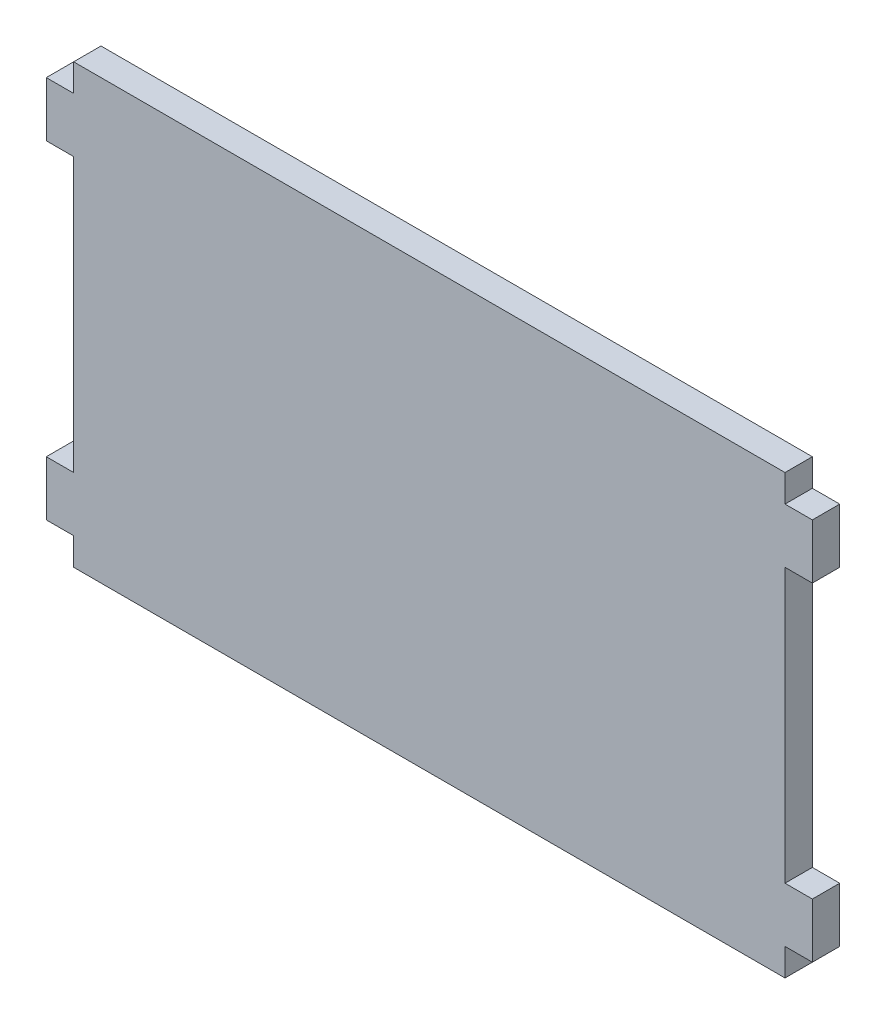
ISO-10303-21;
HEADER;
FILE_DESCRIPTION(('STEP AP214'),'2;1');
FILE_NAME('part.step','',(''),(''),'','','');
FILE_SCHEMA(('AUTOMOTIVE_DESIGN { 1 0 10303 214 1 1 1 1 }'));
ENDSEC;
DATA;
#1=APPLICATION_CONTEXT('core data for automotive mechanical design processes');
#2=APPLICATION_PROTOCOL_DEFINITION('international standard','automotive_design',2000,#1);
#3=PRODUCT_CONTEXT('',#1,'mechanical');
#4=PRODUCT('Part','Part','',(#3));
#5=PRODUCT_RELATED_PRODUCT_CATEGORY('part','',(#4));
#6=PRODUCT_DEFINITION_FORMATION('','',#4);
#7=PRODUCT_DEFINITION_CONTEXT('part definition',#1,'design');
#8=PRODUCT_DEFINITION('design','',#6,#7);
#9=PRODUCT_DEFINITION_SHAPE('','',#8);
#10=(LENGTH_UNIT() NAMED_UNIT(*) SI_UNIT(.MILLI.,.METRE.));
#11=(NAMED_UNIT(*) PLANE_ANGLE_UNIT() SI_UNIT($,.RADIAN.));
#12=(NAMED_UNIT(*) SI_UNIT($,.STERADIAN.) SOLID_ANGLE_UNIT());
#13=UNCERTAINTY_MEASURE_WITH_UNIT(LENGTH_MEASURE(1.E-05),#10,'distance_accuracy_value','');
#14=(GEOMETRIC_REPRESENTATION_CONTEXT(3) GLOBAL_UNCERTAINTY_ASSIGNED_CONTEXT((#13)) GLOBAL_UNIT_ASSIGNED_CONTEXT((#10,
#11,#12)) REPRESENTATION_CONTEXT('',''));
#15=CARTESIAN_POINT('',(0.,0.,0.));
#16=DIRECTION('',(0.,0.,1.));
#17=DIRECTION('',(1.,0.,0.));
#18=AXIS2_PLACEMENT_3D('',#15,#16,#17);
#19=CARTESIAN_POINT('',(0.,0.,3.175));
#20=DIRECTION('',(1.,0.,0.));
#21=DIRECTION('',(0.,1.,0.));
#22=AXIS2_PLACEMENT_3D('',#19,#20,#21);
#23=PLANE('',#22);
#24=DIRECTION('',(0.,-1.,0.));
#25=VECTOR('',#24,1.);
#26=CARTESIAN_POINT('',(0.,0.,0.));
#27=LINE('',#26,#25);
#28=CARTESIAN_POINT('',(0.,3.175,0.));
#29=VERTEX_POINT('',#28);
#30=CARTESIAN_POINT('',(0.,0.,0.));
#31=VERTEX_POINT('',#30);
#32=EDGE_CURVE('E202',#29,#31,#27,.T.);
#33=ORIENTED_EDGE('',*,*,#32,.T.);
#34=DIRECTION('',(0.,0.,-1.));
#35=VECTOR('',#34,1.);
#36=CARTESIAN_POINT('',(0.,0.,3.175));
#37=LINE('',#36,#35);
#38=CARTESIAN_POINT('',(0.,0.,3.175));
#39=VERTEX_POINT('',#38);
#40=EDGE_CURVE('E11',#39,#31,#37,.T.);
#41=ORIENTED_EDGE('',*,*,#40,.F.);
#42=DIRECTION('',(0.,-1.,0.));
#43=VECTOR('',#42,1.);
#44=CARTESIAN_POINT('',(0.,0.,3.175));
#45=LINE('',#44,#43);
#46=CARTESIAN_POINT('',(0.,3.175,3.175));
#47=VERTEX_POINT('',#46);
#48=EDGE_CURVE('E240',#47,#39,#45,.T.);
#49=ORIENTED_EDGE('',*,*,#48,.F.);
#50=DIRECTION('',(0.,0.,-1.));
#51=VECTOR('',#50,1.);
#52=CARTESIAN_POINT('',(0.,3.175,3.175));
#53=LINE('',#52,#51);
#54=EDGE_CURVE('E198',#47,#29,#53,.T.);
#55=ORIENTED_EDGE('',*,*,#54,.T.);
#56=EDGE_LOOP('',(#33,#41,#49,#55));
#57=FACE_BOUND('',#56,.T.);
#58=ADVANCED_FACE('F34',(#57),#23,.F.);
#59=CARTESIAN_POINT('',(0.,0.,3.175));
#60=DIRECTION('',(0.,1.,0.));
#61=DIRECTION('',(-1.,0.,0.));
#62=AXIS2_PLACEMENT_3D('',#59,#60,#61);
#63=PLANE('',#62);
#64=DIRECTION('',(1.,0.,0.));
#65=VECTOR('',#64,1.);
#66=CARTESIAN_POINT('',(0.,0.,0.));
#67=LINE('',#66,#65);
#68=CARTESIAN_POINT('',(82.55,0.,0.));
#69=VERTEX_POINT('',#68);
#70=EDGE_CURVE('E205',#31,#69,#67,.T.);
#71=ORIENTED_EDGE('',*,*,#70,.T.);
#72=DIRECTION('',(0.,0.,-1.));
#73=VECTOR('',#72,1.);
#74=CARTESIAN_POINT('',(82.55,0.,3.175));
#75=LINE('',#74,#73);
#76=CARTESIAN_POINT('',(82.55,0.,3.175));
#77=VERTEX_POINT('',#76);
#78=EDGE_CURVE('E42',#77,#69,#75,.T.);
#79=ORIENTED_EDGE('',*,*,#78,.F.);
#80=DIRECTION('',(1.,0.,0.));
#81=VECTOR('',#80,1.);
#82=CARTESIAN_POINT('',(0.,0.,3.175));
#83=LINE('',#82,#81);
#84=EDGE_CURVE('E129',#39,#77,#83,.T.);
#85=ORIENTED_EDGE('',*,*,#84,.F.);
#86=ORIENTED_EDGE('',*,*,#40,.T.);
#87=EDGE_LOOP('',(#71,#79,#85,#86));
#88=FACE_BOUND('',#87,.T.);
#89=ADVANCED_FACE('F359',(#88),#63,.F.);
#90=CARTESIAN_POINT('',(82.55,0.,3.175));
#91=DIRECTION('',(-1.,0.,0.));
#92=DIRECTION('',(0.,-1.,0.));
#93=AXIS2_PLACEMENT_3D('',#90,#91,#92);
#94=PLANE('',#93);
#95=DIRECTION('',(0.,1.,0.));
#96=VECTOR('',#95,1.);
#97=CARTESIAN_POINT('',(82.55,0.,0.));
#98=LINE('',#97,#96);
#99=CARTESIAN_POINT('',(82.55,3.17500000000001,0.));
#100=VERTEX_POINT('',#99);
#101=EDGE_CURVE('E207',#69,#100,#98,.T.);
#102=ORIENTED_EDGE('',*,*,#101,.T.);
#103=DIRECTION('',(0.,0.,-1.));
#104=VECTOR('',#103,1.);
#105=CARTESIAN_POINT('',(82.55,3.17500000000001,3.175));
#106=LINE('',#105,#104);
#107=CARTESIAN_POINT('',(82.55,3.17500000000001,3.175));
#108=VERTEX_POINT('',#107);
#109=EDGE_CURVE('E283',#108,#100,#106,.T.);
#110=ORIENTED_EDGE('',*,*,#109,.F.);
#111=DIRECTION('',(0.,1.,0.));
#112=VECTOR('',#111,1.);
#113=CARTESIAN_POINT('',(82.55,0.,3.175));
#114=LINE('',#113,#112);
#115=EDGE_CURVE('E291',#77,#108,#114,.T.);
#116=ORIENTED_EDGE('',*,*,#115,.F.);
#117=ORIENTED_EDGE('',*,*,#78,.T.);
#118=EDGE_LOOP('',(#102,#110,#116,#117));
#119=FACE_BOUND('',#118,.T.);
#120=ADVANCED_FACE('F289',(#119),#94,.F.);
#121=CARTESIAN_POINT('',(82.55,3.17500000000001,3.175));
#122=DIRECTION('',(0.,1.,0.));
#123=DIRECTION('',(-1.,0.,0.));
#124=AXIS2_PLACEMENT_3D('',#121,#122,#123);
#125=PLANE('',#124);
#126=DIRECTION('',(1.,0.,0.));
#127=VECTOR('',#126,1.);
#128=CARTESIAN_POINT('',(82.55,3.17500000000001,0.));
#129=LINE('',#128,#127);
#130=CARTESIAN_POINT('',(85.725,3.17500000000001,0.));
#131=VERTEX_POINT('',#130);
#132=EDGE_CURVE('E209',#100,#131,#129,.T.);
#133=ORIENTED_EDGE('',*,*,#132,.T.);
#134=DIRECTION('',(0.,0.,-1.));
#135=VECTOR('',#134,1.);
#136=CARTESIAN_POINT('',(85.725,3.17500000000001,3.175));
#137=LINE('',#136,#135);
#138=CARTESIAN_POINT('',(85.725,3.17500000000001,3.175));
#139=VERTEX_POINT('',#138);
#140=EDGE_CURVE('E280',#139,#131,#137,.T.);
#141=ORIENTED_EDGE('',*,*,#140,.F.);
#142=DIRECTION('',(1.,0.,0.));
#143=VECTOR('',#142,1.);
#144=CARTESIAN_POINT('',(82.55,3.17500000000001,3.175));
#145=LINE('',#144,#143);
#146=EDGE_CURVE('E309',#108,#139,#145,.T.);
#147=ORIENTED_EDGE('',*,*,#146,.F.);
#148=ORIENTED_EDGE('',*,*,#109,.T.);
#149=EDGE_LOOP('',(#133,#141,#147,#148));
#150=FACE_BOUND('',#149,.T.);
#151=ADVANCED_FACE('F300',(#150),#125,.F.);
#152=CARTESIAN_POINT('',(85.725,3.17500000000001,3.175));
#153=DIRECTION('',(-1.,0.,0.));
#154=DIRECTION('',(0.,0.,1.));
#155=AXIS2_PLACEMENT_3D('',#152,#153,#154);
#156=PLANE('',#155);
#157=DIRECTION('',(0.,1.,0.));
#158=VECTOR('',#157,1.);
#159=CARTESIAN_POINT('',(85.725,3.17500000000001,0.));
#160=LINE('',#159,#158);
#161=CARTESIAN_POINT('',(85.725,9.52500000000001,0.));
#162=VERTEX_POINT('',#161);
#163=EDGE_CURVE('E211',#131,#162,#160,.T.);
#164=ORIENTED_EDGE('',*,*,#163,.T.);
#165=DIRECTION('',(0.,0.,-1.));
#166=VECTOR('',#165,1.);
#167=CARTESIAN_POINT('',(85.725,9.52500000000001,3.175));
#168=LINE('',#167,#166);
#169=CARTESIAN_POINT('',(85.725,9.52500000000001,3.175));
#170=VERTEX_POINT('',#169);
#171=EDGE_CURVE('E277',#170,#162,#168,.T.);
#172=ORIENTED_EDGE('',*,*,#171,.F.);
#173=DIRECTION('',(0.,1.,0.));
#174=VECTOR('',#173,1.);
#175=CARTESIAN_POINT('',(85.725,3.17500000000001,3.175));
#176=LINE('',#175,#174);
#177=EDGE_CURVE('E306',#139,#170,#176,.T.);
#178=ORIENTED_EDGE('',*,*,#177,.F.);
#179=ORIENTED_EDGE('',*,*,#140,.T.);
#180=EDGE_LOOP('',(#164,#172,#178,#179));
#181=FACE_BOUND('',#180,.T.);
#182=ADVANCED_FACE('F304',(#181),#156,.F.);
#183=CARTESIAN_POINT('',(82.55,9.52500000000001,3.175));
#184=DIRECTION('',(0.,-1.,0.));
#185=DIRECTION('',(0.,0.,-1.));
#186=AXIS2_PLACEMENT_3D('',#183,#184,#185);
#187=PLANE('',#186);
#188=DIRECTION('',(-1.,0.,0.));
#189=VECTOR('',#188,1.);
#190=CARTESIAN_POINT('',(82.55,9.52500000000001,0.));
#191=LINE('',#190,#189);
#192=CARTESIAN_POINT('',(82.55,9.52500000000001,0.));
#193=VERTEX_POINT('',#192);
#194=EDGE_CURVE('E213',#162,#193,#191,.T.);
#195=ORIENTED_EDGE('',*,*,#194,.T.);
#196=DIRECTION('',(0.,0.,-1.));
#197=VECTOR('',#196,1.);
#198=CARTESIAN_POINT('',(82.55,9.52500000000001,3.175));
#199=LINE('',#198,#197);
#200=CARTESIAN_POINT('',(82.55,9.52500000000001,3.175));
#201=VERTEX_POINT('',#200);
#202=EDGE_CURVE('E274',#201,#193,#199,.T.);
#203=ORIENTED_EDGE('',*,*,#202,.F.);
#204=DIRECTION('',(-1.,0.,0.));
#205=VECTOR('',#204,1.);
#206=CARTESIAN_POINT('',(82.55,9.52500000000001,3.175));
#207=LINE('',#206,#205);
#208=EDGE_CURVE('E308',#170,#201,#207,.T.);
#209=ORIENTED_EDGE('',*,*,#208,.F.);
#210=ORIENTED_EDGE('',*,*,#171,.T.);
#211=EDGE_LOOP('',(#195,#203,#209,#210));
#212=FACE_BOUND('',#211,.T.);
#213=ADVANCED_FACE('F372',(#212),#187,.F.);
#214=CARTESIAN_POINT('',(82.55,9.52500000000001,3.175));
#215=DIRECTION('',(-1.,0.,0.));
#216=DIRECTION('',(0.,0.,1.));
#217=AXIS2_PLACEMENT_3D('',#214,#215,#216);
#218=PLANE('',#217);
#219=DIRECTION('',(0.,1.,0.));
#220=VECTOR('',#219,1.);
#221=CARTESIAN_POINT('',(82.55,9.52500000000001,0.));
#222=LINE('',#221,#220);
#223=CARTESIAN_POINT('',(82.55,41.275,0.));
#224=VERTEX_POINT('',#223);
#225=EDGE_CURVE('E215',#193,#224,#222,.T.);
#226=ORIENTED_EDGE('',*,*,#225,.T.);
#227=DIRECTION('',(0.,0.,-1.));
#228=VECTOR('',#227,1.);
#229=CARTESIAN_POINT('',(82.55,41.275,3.175));
#230=LINE('',#229,#228);
#231=CARTESIAN_POINT('',(82.55,41.275,3.175));
#232=VERTEX_POINT('',#231);
#233=EDGE_CURVE('E271',#232,#224,#230,.T.);
#234=ORIENTED_EDGE('',*,*,#233,.F.);
#235=DIRECTION('',(0.,1.,0.));
#236=VECTOR('',#235,1.);
#237=CARTESIAN_POINT('',(82.55,9.52500000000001,3.175));
#238=LINE('',#237,#236);
#239=EDGE_CURVE('E311',#201,#232,#238,.T.);
#240=ORIENTED_EDGE('',*,*,#239,.F.);
#241=ORIENTED_EDGE('',*,*,#202,.T.);
#242=EDGE_LOOP('',(#226,#234,#240,#241));
#243=FACE_BOUND('',#242,.T.);
#244=ADVANCED_FACE('F375',(#243),#218,.F.);
#245=CARTESIAN_POINT('',(82.55,41.275,3.175));
#246=DIRECTION('',(0.,1.,0.));
#247=DIRECTION('',(0.,0.,1.));
#248=AXIS2_PLACEMENT_3D('',#245,#246,#247);
#249=PLANE('',#248);
#250=DIRECTION('',(1.,0.,0.));
#251=VECTOR('',#250,1.);
#252=CARTESIAN_POINT('',(82.55,41.275,0.));
#253=LINE('',#252,#251);
#254=CARTESIAN_POINT('',(85.725,41.275,0.));
#255=VERTEX_POINT('',#254);
#256=EDGE_CURVE('E217',#224,#255,#253,.T.);
#257=ORIENTED_EDGE('',*,*,#256,.T.);
#258=DIRECTION('',(0.,0.,-1.));
#259=VECTOR('',#258,1.);
#260=CARTESIAN_POINT('',(85.725,41.275,3.175));
#261=LINE('',#260,#259);
#262=CARTESIAN_POINT('',(85.725,41.275,3.175));
#263=VERTEX_POINT('',#262);
#264=EDGE_CURVE('E268',#263,#255,#261,.T.);
#265=ORIENTED_EDGE('',*,*,#264,.F.);
#266=DIRECTION('',(1.,0.,0.));
#267=VECTOR('',#266,1.);
#268=CARTESIAN_POINT('',(82.55,41.275,3.175));
#269=LINE('',#268,#267);
#270=EDGE_CURVE('E317',#232,#263,#269,.T.);
#271=ORIENTED_EDGE('',*,*,#270,.F.);
#272=ORIENTED_EDGE('',*,*,#233,.T.);
#273=EDGE_LOOP('',(#257,#265,#271,#272));
#274=FACE_BOUND('',#273,.T.);
#275=ADVANCED_FACE('F379',(#274),#249,.F.);
#276=CARTESIAN_POINT('',(85.725,47.625,3.175));
#277=DIRECTION('',(-1.,0.,0.));
#278=DIRECTION('',(0.,0.,1.));
#279=AXIS2_PLACEMENT_3D('',#276,#277,#278);
#280=PLANE('',#279);
#281=DIRECTION('',(0.,1.,0.));
#282=VECTOR('',#281,1.);
#283=CARTESIAN_POINT('',(85.725,47.625,0.));
#284=LINE('',#283,#282);
#285=CARTESIAN_POINT('',(85.725,47.625,0.));
#286=VERTEX_POINT('',#285);
#287=EDGE_CURVE('E219',#255,#286,#284,.T.);
#288=ORIENTED_EDGE('',*,*,#287,.T.);
#289=DIRECTION('',(0.,0.,-1.));
#290=VECTOR('',#289,1.);
#291=CARTESIAN_POINT('',(85.725,47.625,3.175));
#292=LINE('',#291,#290);
#293=CARTESIAN_POINT('',(85.725,47.625,3.175));
#294=VERTEX_POINT('',#293);
#295=EDGE_CURVE('E265',#294,#286,#292,.T.);
#296=ORIENTED_EDGE('',*,*,#295,.F.);
#297=DIRECTION('',(0.,1.,0.));
#298=VECTOR('',#297,1.);
#299=CARTESIAN_POINT('',(85.725,47.625,3.175));
#300=LINE('',#299,#298);
#301=EDGE_CURVE('E319',#263,#294,#300,.T.);
#302=ORIENTED_EDGE('',*,*,#301,.F.);
#303=ORIENTED_EDGE('',*,*,#264,.T.);
#304=EDGE_LOOP('',(#288,#296,#302,#303));
#305=FACE_BOUND('',#304,.T.);
#306=ADVANCED_FACE('F383',(#305),#280,.F.);
#307=CARTESIAN_POINT('',(82.55,47.625,3.175));
#308=DIRECTION('',(0.,-1.,0.));
#309=DIRECTION('',(0.,0.,-1.));
#310=AXIS2_PLACEMENT_3D('',#307,#308,#309);
#311=PLANE('',#310);
#312=DIRECTION('',(-1.,0.,0.));
#313=VECTOR('',#312,1.);
#314=CARTESIAN_POINT('',(82.55,47.625,0.));
#315=LINE('',#314,#313);
#316=CARTESIAN_POINT('',(82.55,47.625,0.));
#317=VERTEX_POINT('',#316);
#318=EDGE_CURVE('E221',#286,#317,#315,.T.);
#319=ORIENTED_EDGE('',*,*,#318,.T.);
#320=DIRECTION('',(0.,0.,-1.));
#321=VECTOR('',#320,1.);
#322=CARTESIAN_POINT('',(82.55,47.625,3.175));
#323=LINE('',#322,#321);
#324=CARTESIAN_POINT('',(82.55,47.625,3.175));
#325=VERTEX_POINT('',#324);
#326=EDGE_CURVE('E262',#325,#317,#323,.T.);
#327=ORIENTED_EDGE('',*,*,#326,.F.);
#328=DIRECTION('',(-1.,0.,0.));
#329=VECTOR('',#328,1.);
#330=CARTESIAN_POINT('',(82.55,47.625,3.175));
#331=LINE('',#330,#329);
#332=EDGE_CURVE('E321',#294,#325,#331,.T.);
#333=ORIENTED_EDGE('',*,*,#332,.F.);
#334=ORIENTED_EDGE('',*,*,#295,.T.);
#335=EDGE_LOOP('',(#319,#327,#333,#334));
#336=FACE_BOUND('',#335,.T.);
#337=ADVANCED_FACE('F387',(#336),#311,.F.);
#338=CARTESIAN_POINT('',(82.55,47.625,3.175));
#339=DIRECTION('',(-1.,0.,0.));
#340=DIRECTION('',(0.,0.,1.));
#341=AXIS2_PLACEMENT_3D('',#338,#339,#340);
#342=PLANE('',#341);
#343=DIRECTION('',(0.,1.,0.));
#344=VECTOR('',#343,1.);
#345=CARTESIAN_POINT('',(82.55,47.625,0.));
#346=LINE('',#345,#344);
#347=CARTESIAN_POINT('',(82.55,50.8,0.));
#348=VERTEX_POINT('',#347);
#349=EDGE_CURVE('E223',#317,#348,#346,.T.);
#350=ORIENTED_EDGE('',*,*,#349,.T.);
#351=DIRECTION('',(0.,0.,-1.));
#352=VECTOR('',#351,1.);
#353=CARTESIAN_POINT('',(82.55,50.8,3.175));
#354=LINE('',#353,#352);
#355=CARTESIAN_POINT('',(82.55,50.8,3.175));
#356=VERTEX_POINT('',#355);
#357=EDGE_CURVE('E259',#356,#348,#354,.T.);
#358=ORIENTED_EDGE('',*,*,#357,.F.);
#359=DIRECTION('',(0.,1.,0.));
#360=VECTOR('',#359,1.);
#361=CARTESIAN_POINT('',(82.55,47.625,3.175));
#362=LINE('',#361,#360);
#363=EDGE_CURVE('E323',#325,#356,#362,.T.);
#364=ORIENTED_EDGE('',*,*,#363,.F.);
#365=ORIENTED_EDGE('',*,*,#326,.T.);
#366=EDGE_LOOP('',(#350,#358,#364,#365));
#367=FACE_BOUND('',#366,.T.);
#368=ADVANCED_FACE('F391',(#367),#342,.F.);
#369=CARTESIAN_POINT('',(0.,50.8,3.175));
#370=DIRECTION('',(0.,-1.,0.));
#371=DIRECTION('',(1.,0.,0.));
#372=AXIS2_PLACEMENT_3D('',#369,#370,#371);
#373=PLANE('',#372);
#374=DIRECTION('',(-1.,0.,0.));
#375=VECTOR('',#374,1.);
#376=CARTESIAN_POINT('',(0.,50.8,0.));
#377=LINE('',#376,#375);
#378=CARTESIAN_POINT('',(0.,50.8,0.));
#379=VERTEX_POINT('',#378);
#380=EDGE_CURVE('E225',#348,#379,#377,.T.);
#381=ORIENTED_EDGE('',*,*,#380,.T.);
#382=DIRECTION('',(0.,0.,-1.));
#383=VECTOR('',#382,1.);
#384=CARTESIAN_POINT('',(0.,50.8,3.175));
#385=LINE('',#384,#383);
#386=CARTESIAN_POINT('',(0.,50.8,3.175));
#387=VERTEX_POINT('',#386);
#388=EDGE_CURVE('E256',#387,#379,#385,.T.);
#389=ORIENTED_EDGE('',*,*,#388,.F.);
#390=DIRECTION('',(-1.,0.,0.));
#391=VECTOR('',#390,1.);
#392=CARTESIAN_POINT('',(0.,50.8,3.175));
#393=LINE('',#392,#391);
#394=EDGE_CURVE('E325',#356,#387,#393,.T.);
#395=ORIENTED_EDGE('',*,*,#394,.F.);
#396=ORIENTED_EDGE('',*,*,#357,.T.);
#397=EDGE_LOOP('',(#381,#389,#395,#396));
#398=FACE_BOUND('',#397,.T.);
#399=ADVANCED_FACE('F395',(#398),#373,.F.);
#400=CARTESIAN_POINT('',(0.,47.625,3.175));
#401=DIRECTION('',(1.,0.,0.));
#402=DIRECTION('',(0.,0.,-1.));
#403=AXIS2_PLACEMENT_3D('',#400,#401,#402);
#404=PLANE('',#403);
#405=DIRECTION('',(0.,-1.,0.));
#406=VECTOR('',#405,1.);
#407=CARTESIAN_POINT('',(0.,47.625,0.));
#408=LINE('',#407,#406);
#409=CARTESIAN_POINT('',(0.,47.625,0.));
#410=VERTEX_POINT('',#409);
#411=EDGE_CURVE('E227',#379,#410,#408,.T.);
#412=ORIENTED_EDGE('',*,*,#411,.T.);
#413=DIRECTION('',(0.,0.,-1.));
#414=VECTOR('',#413,1.);
#415=CARTESIAN_POINT('',(0.,47.625,3.175));
#416=LINE('',#415,#414);
#417=CARTESIAN_POINT('',(0.,47.625,3.175));
#418=VERTEX_POINT('',#417);
#419=EDGE_CURVE('E253',#418,#410,#416,.T.);
#420=ORIENTED_EDGE('',*,*,#419,.F.);
#421=DIRECTION('',(0.,-1.,0.));
#422=VECTOR('',#421,1.);
#423=CARTESIAN_POINT('',(0.,47.625,3.175));
#424=LINE('',#423,#422);
#425=EDGE_CURVE('E327',#387,#418,#424,.T.);
#426=ORIENTED_EDGE('',*,*,#425,.F.);
#427=ORIENTED_EDGE('',*,*,#388,.T.);
#428=EDGE_LOOP('',(#412,#420,#426,#427));
#429=FACE_BOUND('',#428,.T.);
#430=ADVANCED_FACE('F399',(#429),#404,.F.);
#431=CARTESIAN_POINT('',(0.,47.625,3.175));
#432=DIRECTION('',(0.,-1.,0.));
#433=DIRECTION('',(0.,0.,-1.));
#434=AXIS2_PLACEMENT_3D('',#431,#432,#433);
#435=PLANE('',#434);
#436=DIRECTION('',(-1.,0.,0.));
#437=VECTOR('',#436,1.);
#438=CARTESIAN_POINT('',(0.,47.625,0.));
#439=LINE('',#438,#437);
#440=CARTESIAN_POINT('',(-3.175,47.625,0.));
#441=VERTEX_POINT('',#440);
#442=EDGE_CURVE('E229',#410,#441,#439,.T.);
#443=ORIENTED_EDGE('',*,*,#442,.T.);
#444=DIRECTION('',(0.,0.,-1.));
#445=VECTOR('',#444,1.);
#446=CARTESIAN_POINT('',(-3.175,47.625,3.175));
#447=LINE('',#446,#445);
#448=CARTESIAN_POINT('',(-3.175,47.625,3.175));
#449=VERTEX_POINT('',#448);
#450=EDGE_CURVE('E250',#449,#441,#447,.T.);
#451=ORIENTED_EDGE('',*,*,#450,.F.);
#452=DIRECTION('',(-1.,0.,0.));
#453=VECTOR('',#452,1.);
#454=CARTESIAN_POINT('',(0.,47.625,3.175));
#455=LINE('',#454,#453);
#456=EDGE_CURVE('E329',#418,#449,#455,.T.);
#457=ORIENTED_EDGE('',*,*,#456,.F.);
#458=ORIENTED_EDGE('',*,*,#419,.T.);
#459=EDGE_LOOP('',(#443,#451,#457,#458));
#460=FACE_BOUND('',#459,.T.);
#461=ADVANCED_FACE('F403',(#460),#435,.F.);
#462=CARTESIAN_POINT('',(-3.175,47.625,3.175));
#463=DIRECTION('',(1.,0.,0.));
#464=DIRECTION('',(0.,0.,-1.));
#465=AXIS2_PLACEMENT_3D('',#462,#463,#464);
#466=PLANE('',#465);
#467=DIRECTION('',(0.,-1.,0.));
#468=VECTOR('',#467,1.);
#469=CARTESIAN_POINT('',(-3.175,47.625,0.));
#470=LINE('',#469,#468);
#471=CARTESIAN_POINT('',(-3.175,41.275,0.));
#472=VERTEX_POINT('',#471);
#473=EDGE_CURVE('E231',#441,#472,#470,.T.);
#474=ORIENTED_EDGE('',*,*,#473,.T.);
#475=DIRECTION('',(0.,0.,-1.));
#476=VECTOR('',#475,1.);
#477=CARTESIAN_POINT('',(-3.175,41.275,3.175));
#478=LINE('',#477,#476);
#479=CARTESIAN_POINT('',(-3.175,41.275,3.175));
#480=VERTEX_POINT('',#479);
#481=EDGE_CURVE('E247',#480,#472,#478,.T.);
#482=ORIENTED_EDGE('',*,*,#481,.F.);
#483=DIRECTION('',(0.,-1.,0.));
#484=VECTOR('',#483,1.);
#485=CARTESIAN_POINT('',(-3.175,47.625,3.175));
#486=LINE('',#485,#484);
#487=EDGE_CURVE('E331',#449,#480,#486,.T.);
#488=ORIENTED_EDGE('',*,*,#487,.F.);
#489=ORIENTED_EDGE('',*,*,#450,.T.);
#490=EDGE_LOOP('',(#474,#482,#488,#489));
#491=FACE_BOUND('',#490,.T.);
#492=ADVANCED_FACE('F407',(#491),#466,.F.);
#493=CARTESIAN_POINT('',(0.,41.275,3.175));
#494=DIRECTION('',(0.,1.,0.));
#495=DIRECTION('',(0.,0.,1.));
#496=AXIS2_PLACEMENT_3D('',#493,#494,#495);
#497=PLANE('',#496);
#498=DIRECTION('',(1.,0.,0.));
#499=VECTOR('',#498,1.);
#500=CARTESIAN_POINT('',(0.,41.275,0.));
#501=LINE('',#500,#499);
#502=CARTESIAN_POINT('',(0.,41.275,0.));
#503=VERTEX_POINT('',#502);
#504=EDGE_CURVE('E233',#472,#503,#501,.T.);
#505=ORIENTED_EDGE('',*,*,#504,.T.);
#506=DIRECTION('',(0.,0.,-1.));
#507=VECTOR('',#506,1.);
#508=CARTESIAN_POINT('',(0.,41.275,3.175));
#509=LINE('',#508,#507);
#510=CARTESIAN_POINT('',(0.,41.275,3.175));
#511=VERTEX_POINT('',#510);
#512=EDGE_CURVE('E244',#511,#503,#509,.T.);
#513=ORIENTED_EDGE('',*,*,#512,.F.);
#514=DIRECTION('',(1.,0.,0.));
#515=VECTOR('',#514,1.);
#516=CARTESIAN_POINT('',(0.,41.275,3.175));
#517=LINE('',#516,#515);
#518=EDGE_CURVE('E333',#480,#511,#517,.T.);
#519=ORIENTED_EDGE('',*,*,#518,.F.);
#520=ORIENTED_EDGE('',*,*,#481,.T.);
#521=EDGE_LOOP('',(#505,#513,#519,#520));
#522=FACE_BOUND('',#521,.T.);
#523=ADVANCED_FACE('F339',(#522),#497,.F.);
#524=CARTESIAN_POINT('',(0.,9.52500000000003,3.175));
#525=DIRECTION('',(1.,0.,0.));
#526=DIRECTION('',(0.,0.,-1.));
#527=AXIS2_PLACEMENT_3D('',#524,#525,#526);
#528=PLANE('',#527);
#529=DIRECTION('',(0.,-1.,0.));
#530=VECTOR('',#529,1.);
#531=CARTESIAN_POINT('',(0.,9.52500000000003,0.));
#532=LINE('',#531,#530);
#533=CARTESIAN_POINT('',(0.,9.52500000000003,0.));
#534=VERTEX_POINT('',#533);
#535=EDGE_CURVE('E235',#503,#534,#532,.T.);
#536=ORIENTED_EDGE('',*,*,#535,.T.);
#537=DIRECTION('',(0.,0.,-1.));
#538=VECTOR('',#537,1.);
#539=CARTESIAN_POINT('',(0.,9.52500000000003,3.175));
#540=LINE('',#539,#538);
#541=CARTESIAN_POINT('',(0.,9.52500000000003,3.175));
#542=VERTEX_POINT('',#541);
#543=EDGE_CURVE('E193',#542,#534,#540,.T.);
#544=ORIENTED_EDGE('',*,*,#543,.F.);
#545=DIRECTION('',(0.,-1.,0.));
#546=VECTOR('',#545,1.);
#547=CARTESIAN_POINT('',(0.,9.52500000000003,3.175));
#548=LINE('',#547,#546);
#549=EDGE_CURVE('E184',#511,#542,#548,.T.);
#550=ORIENTED_EDGE('',*,*,#549,.F.);
#551=ORIENTED_EDGE('',*,*,#512,.T.);
#552=EDGE_LOOP('',(#536,#544,#550,#551));
#553=FACE_BOUND('',#552,.T.);
#554=ADVANCED_FACE('F343',(#553),#528,.F.);
#555=CARTESIAN_POINT('',(0.,9.52500000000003,3.175));
#556=DIRECTION('',(0.,-1.,0.));
#557=DIRECTION('',(1.,0.,0.));
#558=AXIS2_PLACEMENT_3D('',#555,#556,#557);
#559=PLANE('',#558);
#560=DIRECTION('',(-1.,0.,0.));
#561=VECTOR('',#560,1.);
#562=CARTESIAN_POINT('',(0.,9.52500000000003,0.));
#563=LINE('',#562,#561);
#564=CARTESIAN_POINT('',(-3.17499999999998,9.525,0.));
#565=VERTEX_POINT('',#564);
#566=EDGE_CURVE('E192',#534,#565,#563,.T.);
#567=ORIENTED_EDGE('',*,*,#566,.T.);
#568=DIRECTION('',(0.,0.,-1.));
#569=VECTOR('',#568,1.);
#570=CARTESIAN_POINT('',(-3.17499999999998,9.525,3.175));
#571=LINE('',#570,#569);
#572=CARTESIAN_POINT('',(-3.17499999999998,9.525,3.175));
#573=VERTEX_POINT('',#572);
#574=EDGE_CURVE('E189',#573,#565,#571,.T.);
#575=ORIENTED_EDGE('',*,*,#574,.F.);
#576=DIRECTION('',(-1.,0.,0.));
#577=VECTOR('',#576,1.);
#578=CARTESIAN_POINT('',(0.,9.52500000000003,3.175));
#579=LINE('',#578,#577);
#580=EDGE_CURVE('E178',#542,#573,#579,.T.);
#581=ORIENTED_EDGE('',*,*,#580,.F.);
#582=ORIENTED_EDGE('',*,*,#543,.T.);
#583=EDGE_LOOP('',(#567,#575,#581,#582));
#584=FACE_BOUND('',#583,.T.);
#585=ADVANCED_FACE('F190',(#584),#559,.F.);
#586=CARTESIAN_POINT('',(-3.17499999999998,3.175,3.175));
#587=DIRECTION('',(1.,0.,0.));
#588=DIRECTION('',(0.,0.,-1.));
#589=AXIS2_PLACEMENT_3D('',#586,#587,#588);
#590=PLANE('',#589);
#591=DIRECTION('',(0.,-1.,0.));
#592=VECTOR('',#591,1.);
#593=CARTESIAN_POINT('',(-3.17499999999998,3.175,0.));
#594=LINE('',#593,#592);
#595=CARTESIAN_POINT('',(-3.17499999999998,3.175,0.));
#596=VERTEX_POINT('',#595);
#597=EDGE_CURVE('E115',#565,#596,#594,.T.);
#598=ORIENTED_EDGE('',*,*,#597,.T.);
#599=DIRECTION('',(0.,0.,-1.));
#600=VECTOR('',#599,1.);
#601=CARTESIAN_POINT('',(-3.17499999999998,3.175,3.175));
#602=LINE('',#601,#600);
#603=CARTESIAN_POINT('',(-3.17499999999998,3.175,3.175));
#604=VERTEX_POINT('',#603);
#605=EDGE_CURVE('E194',#604,#596,#602,.T.);
#606=ORIENTED_EDGE('',*,*,#605,.F.);
#607=DIRECTION('',(0.,-1.,0.));
#608=VECTOR('',#607,1.);
#609=CARTESIAN_POINT('',(-3.17499999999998,3.175,3.175));
#610=LINE('',#609,#608);
#611=EDGE_CURVE('E182',#573,#604,#610,.T.);
#612=ORIENTED_EDGE('',*,*,#611,.F.);
#613=ORIENTED_EDGE('',*,*,#574,.T.);
#614=EDGE_LOOP('',(#598,#606,#612,#613));
#615=FACE_BOUND('',#614,.T.);
#616=ADVANCED_FACE('F196',(#615),#590,.F.);
#617=CARTESIAN_POINT('',(0.,3.175,3.175));
#618=DIRECTION('',(0.,1.,0.));
#619=DIRECTION('',(-1.,0.,0.));
#620=AXIS2_PLACEMENT_3D('',#617,#618,#619);
#621=PLANE('',#620);
#622=DIRECTION('',(1.,0.,0.));
#623=VECTOR('',#622,1.);
#624=CARTESIAN_POINT('',(0.,3.175,0.));
#625=LINE('',#624,#623);
#626=EDGE_CURVE('E121',#596,#29,#625,.T.);
#627=ORIENTED_EDGE('',*,*,#626,.T.);
#628=ORIENTED_EDGE('',*,*,#54,.F.);
#629=DIRECTION('',(1.,0.,0.));
#630=VECTOR('',#629,1.);
#631=CARTESIAN_POINT('',(0.,3.175,3.175));
#632=LINE('',#631,#630);
#633=EDGE_CURVE('E50',#604,#47,#632,.T.);
#634=ORIENTED_EDGE('',*,*,#633,.F.);
#635=ORIENTED_EDGE('',*,*,#605,.T.);
#636=EDGE_LOOP('',(#627,#628,#634,#635));
#637=FACE_BOUND('',#636,.T.);
#638=ADVANCED_FACE('F347',(#637),#621,.F.);
#639=CARTESIAN_POINT('',(0.,0.,3.175));
#640=DIRECTION('',(0.,0.,1.));
#641=DIRECTION('',(1.,0.,0.));
#642=AXIS2_PLACEMENT_3D('',#639,#640,#641);
#643=PLANE('',#642);
#644=ORIENTED_EDGE('',*,*,#48,.T.);
#645=ORIENTED_EDGE('',*,*,#84,.T.);
#646=ORIENTED_EDGE('',*,*,#115,.T.);
#647=ORIENTED_EDGE('',*,*,#146,.T.);
#648=ORIENTED_EDGE('',*,*,#177,.T.);
#649=ORIENTED_EDGE('',*,*,#208,.T.);
#650=ORIENTED_EDGE('',*,*,#239,.T.);
#651=ORIENTED_EDGE('',*,*,#270,.T.);
#652=ORIENTED_EDGE('',*,*,#301,.T.);
#653=ORIENTED_EDGE('',*,*,#332,.T.);
#654=ORIENTED_EDGE('',*,*,#363,.T.);
#655=ORIENTED_EDGE('',*,*,#394,.T.);
#656=ORIENTED_EDGE('',*,*,#425,.T.);
#657=ORIENTED_EDGE('',*,*,#456,.T.);
#658=ORIENTED_EDGE('',*,*,#487,.T.);
#659=ORIENTED_EDGE('',*,*,#518,.T.);
#660=ORIENTED_EDGE('',*,*,#549,.T.);
#661=ORIENTED_EDGE('',*,*,#580,.T.);
#662=ORIENTED_EDGE('',*,*,#611,.T.);
#663=ORIENTED_EDGE('',*,*,#633,.T.);
#664=EDGE_LOOP('',(#644,#645,#646,#647,#648,#649,#650,#651,#652,#653,#654,#655,#656,#657,#658,
#659,#660,#661,#662,#663));
#665=FACE_BOUND('',#664,.T.);
#666=ADVANCED_FACE('F180',(#665),#643,.T.);
#667=CARTESIAN_POINT('',(0.,0.,0.));
#668=DIRECTION('',(0.,0.,1.));
#669=DIRECTION('',(1.,0.,0.));
#670=AXIS2_PLACEMENT_3D('',#667,#668,#669);
#671=PLANE('',#670);
#672=ORIENTED_EDGE('',*,*,#32,.F.);
#673=ORIENTED_EDGE('',*,*,#626,.F.);
#674=ORIENTED_EDGE('',*,*,#597,.F.);
#675=ORIENTED_EDGE('',*,*,#566,.F.);
#676=ORIENTED_EDGE('',*,*,#535,.F.);
#677=ORIENTED_EDGE('',*,*,#504,.F.);
#678=ORIENTED_EDGE('',*,*,#473,.F.);
#679=ORIENTED_EDGE('',*,*,#442,.F.);
#680=ORIENTED_EDGE('',*,*,#411,.F.);
#681=ORIENTED_EDGE('',*,*,#380,.F.);
#682=ORIENTED_EDGE('',*,*,#349,.F.);
#683=ORIENTED_EDGE('',*,*,#318,.F.);
#684=ORIENTED_EDGE('',*,*,#287,.F.);
#685=ORIENTED_EDGE('',*,*,#256,.F.);
#686=ORIENTED_EDGE('',*,*,#225,.F.);
#687=ORIENTED_EDGE('',*,*,#194,.F.);
#688=ORIENTED_EDGE('',*,*,#163,.F.);
#689=ORIENTED_EDGE('',*,*,#132,.F.);
#690=ORIENTED_EDGE('',*,*,#101,.F.);
#691=ORIENTED_EDGE('',*,*,#70,.F.);
#692=EDGE_LOOP('',(#672,#673,#674,#675,#676,#677,#678,#679,#680,#681,#682,#683,#684,#685,#686,
#687,#688,#689,#690,#691));
#693=FACE_BOUND('',#692,.T.);
#694=ADVANCED_FACE('F295',(#693),#671,.F.);
#695=CLOSED_SHELL('',(#58,#89,#120,#151,#182,#213,#244,#275,#306,#337,#368,#399,#430,#461,#492,
#523,#554,#585,#616,#638,#666,#694));
#696=MANIFOLD_SOLID_BREP('B2',#695);
#697=ADVANCED_BREP_SHAPE_REPRESENTATION('',(#18,#696),#14);
#698=SHAPE_DEFINITION_REPRESENTATION(#9,#697);
ENDSEC;
END-ISO-10303-21;
